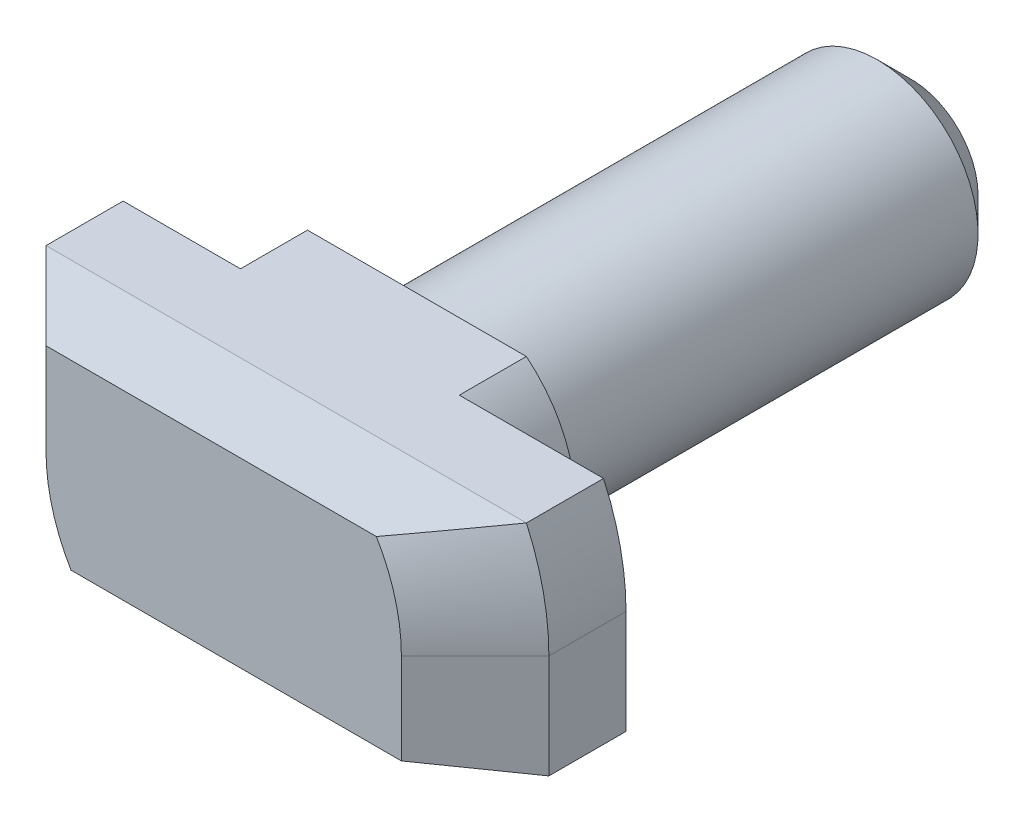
ISO-10303-21;
HEADER;
FILE_DESCRIPTION(('STEP AP214'),'2;1');
FILE_NAME('part.step','',(''),(''),'','','');
FILE_SCHEMA(('AUTOMOTIVE_DESIGN { 1 0 10303 214 1 1 1 1 }'));
ENDSEC;
DATA;
#1=APPLICATION_CONTEXT('core data for automotive mechanical design processes');
#2=APPLICATION_PROTOCOL_DEFINITION('international standard','automotive_design',2000,#1);
#3=PRODUCT_CONTEXT('',#1,'mechanical');
#4=PRODUCT('Part','Part','',(#3));
#5=PRODUCT_RELATED_PRODUCT_CATEGORY('part','',(#4));
#6=PRODUCT_DEFINITION_FORMATION('','',#4);
#7=PRODUCT_DEFINITION_CONTEXT('part definition',#1,'design');
#8=PRODUCT_DEFINITION('design','',#6,#7);
#9=PRODUCT_DEFINITION_SHAPE('','',#8);
#10=(LENGTH_UNIT() NAMED_UNIT(*) SI_UNIT(.MILLI.,.METRE.));
#11=(NAMED_UNIT(*) PLANE_ANGLE_UNIT() SI_UNIT($,.RADIAN.));
#12=(NAMED_UNIT(*) SI_UNIT($,.STERADIAN.) SOLID_ANGLE_UNIT());
#13=UNCERTAINTY_MEASURE_WITH_UNIT(LENGTH_MEASURE(1.E-05),#10,'distance_accuracy_value','');
#14=(GEOMETRIC_REPRESENTATION_CONTEXT(3) GLOBAL_UNCERTAINTY_ASSIGNED_CONTEXT((#13)) GLOBAL_UNIT_ASSIGNED_CONTEXT((#10,
#11,#12)) REPRESENTATION_CONTEXT('',''));
#15=CARTESIAN_POINT('',(0.,0.,0.));
#16=DIRECTION('',(0.,0.,1.));
#17=DIRECTION('',(1.,0.,0.));
#18=AXIS2_PLACEMENT_3D('',#15,#16,#17);
#19=CARTESIAN_POINT('',(5.30000000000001,-3.09999999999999,4.5));
#20=DIRECTION('',(0.707106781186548,0.,0.707106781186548));
#21=DIRECTION('',(0.707106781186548,0.,-0.707106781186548));
#22=AXIS2_PLACEMENT_3D('',#19,#20,#21);
#23=PLANE('',#22);
#24=DIRECTION('',(0.701673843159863,-0.123724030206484,-0.701673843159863));
#25=VECTOR('',#24,1.);
#26=CARTESIAN_POINT('',(5.30000000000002,-2.71208064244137,4.5));
#27=LINE('',#26,#25);
#28=CARTESIAN_POINT('',(5.30000000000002,-2.71208064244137,4.5));
#29=VERTEX_POINT('',#28);
#30=CARTESIAN_POINT('',(7.5,-3.09999999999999,2.3));
#31=VERTEX_POINT('',#30);
#32=EDGE_CURVE('E239',#29,#31,#27,.T.);
#33=ORIENTED_EDGE('',*,*,#32,.T.);
#34=DIRECTION('',(0.,1.,0.));
#35=VECTOR('',#34,1.);
#36=CARTESIAN_POINT('',(7.5,-3.09999999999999,2.30000000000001));
#37=LINE('',#36,#35);
#38=CARTESIAN_POINT('',(7.5,0.,2.30000000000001));
#39=VERTEX_POINT('',#38);
#40=EDGE_CURVE('E241',#39,#31,#37,.F.);
#41=ORIENTED_EDGE('',*,*,#40,.F.);
#42=DIRECTION('',(-0.707106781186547,0.,0.707106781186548));
#43=VECTOR('',#42,1.);
#44=CARTESIAN_POINT('',(7.58485620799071,0.,2.21514379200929));
#45=LINE('',#44,#43);
#46=CARTESIAN_POINT('',(5.30000000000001,0.,4.5));
#47=VERTEX_POINT('',#46);
#48=EDGE_CURVE('E103',#47,#39,#45,.F.);
#49=ORIENTED_EDGE('',*,*,#48,.F.);
#50=DIRECTION('',(0.,-1.,0.));
#51=VECTOR('',#50,1.);
#52=CARTESIAN_POINT('',(5.30000000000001,-3.09999999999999,4.5));
#53=LINE('',#52,#51);
#54=EDGE_CURVE('E271',#29,#47,#53,.F.);
#55=ORIENTED_EDGE('',*,*,#54,.F.);
#56=EDGE_LOOP('',(#33,#41,#49,#55));
#57=FACE_BOUND('',#56,.T.);
#58=ADVANCED_FACE('F16',(#57),#23,.T.);
#59=CARTESIAN_POINT('',(0.,0.,2.30000000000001));
#60=DIRECTION('',(0.,0.,-1.));
#61=DIRECTION('',(0.,1.,0.));
#62=AXIS2_PLACEMENT_3D('',#59,#60,#61);
#63=CONICAL_SURFACE('',#62,7.5,0.785398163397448);
#64=CARTESIAN_POINT('',(-6.82934843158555,-3.09999999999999,2.30000000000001));
#65=CARTESIAN_POINT('',(-6.64116901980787,-3.06741372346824,2.48480595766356));
#66=CARTESIAN_POINT('',(-6.45275253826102,-3.03486855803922,2.66937876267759));
#67=CARTESIAN_POINT('',(-6.07527016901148,-2.96989350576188,3.03787059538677));
#68=CARTESIAN_POINT('',(-5.88620429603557,-2.93746361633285,3.22178963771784));
#69=CARTESIAN_POINT('',(-5.50723735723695,-2.87275034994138,3.58879680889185));
#70=CARTESIAN_POINT('',(-5.31733628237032,-2.84046697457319,3.77188492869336));
#71=CARTESIAN_POINT('',(-4.93637796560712,-2.77610518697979,4.13689876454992));
#72=CARTESIAN_POINT('',(-4.74532069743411,-2.74402677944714,4.31882445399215));
#73=CARTESIAN_POINT('',(-4.55352814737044,-2.71208064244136,4.5));
#74=B_SPLINE_CURVE_WITH_KNOTS('',3,(#64,#65,#66,#67,#68,#69,#70,#71,#72,#73),.UNSPECIFIED.,.F.,
.F.,(4,2,2,2,4),(0.,0.797270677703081,1.59452339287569,2.39178476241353,3.1890643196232),.UNSPECIFIED.);
#75=CARTESIAN_POINT('',(-6.82934843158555,-3.09999999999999,2.30000000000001));
#76=VERTEX_POINT('',#75);
#77=CARTESIAN_POINT('',(-4.55352814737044,-2.71208064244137,4.5));
#78=VERTEX_POINT('',#77);
#79=EDGE_CURVE('E236',#76,#78,#74,.T.);
#80=ORIENTED_EDGE('',*,*,#79,.T.);
#81=CARTESIAN_POINT('',(0.,0.,4.5));
#82=DIRECTION('',(0.,0.,-1.));
#83=DIRECTION('',(0.,1.,0.));
#84=AXIS2_PLACEMENT_3D('',#81,#82,#83);
#85=CIRCLE('',#84,5.30000000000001);
#86=CARTESIAN_POINT('',(-5.3,0.,4.5));
#87=VERTEX_POINT('',#86);
#88=EDGE_CURVE('E19',#87,#78,#85,.F.);
#89=ORIENTED_EDGE('',*,*,#88,.F.);
#90=DIRECTION('',(0.707106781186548,0.,0.707106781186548));
#91=VECTOR('',#90,1.);
#92=CARTESIAN_POINT('',(-7.5,0.,2.3));
#93=LINE('',#92,#91);
#94=CARTESIAN_POINT('',(-7.5,0.,2.30000000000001));
#95=VERTEX_POINT('',#94);
#96=EDGE_CURVE('E268',#95,#87,#93,.T.);
#97=ORIENTED_EDGE('',*,*,#96,.F.);
#98=CARTESIAN_POINT('',(0.,0.,2.30000000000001));
#99=DIRECTION('',(0.,0.,-1.));
#100=DIRECTION('',(0.,1.,0.));
#101=AXIS2_PLACEMENT_3D('',#98,#99,#100);
#102=CIRCLE('',#101,7.5);
#103=EDGE_CURVE('E222',#76,#95,#102,.T.);
#104=ORIENTED_EDGE('',*,*,#103,.F.);
#105=EDGE_LOOP('',(#80,#89,#97,#104));
#106=FACE_BOUND('',#105,.T.);
#107=ADVANCED_FACE('F328',(#106),#63,.T.);
#108=CARTESIAN_POINT('',(-5.30000000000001,-3.09999999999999,4.5));
#109=DIRECTION('',(0.,0.,1.));
#110=DIRECTION('',(0.,-1.,0.));
#111=AXIS2_PLACEMENT_3D('',#108,#109,#110);
#112=PLANE('',#111);
#113=CARTESIAN_POINT('',(0.,0.,4.5));
#114=DIRECTION('',(0.,0.,-1.));
#115=DIRECTION('',(0.,1.,0.));
#116=AXIS2_PLACEMENT_3D('',#113,#114,#115);
#117=CIRCLE('',#116,5.3);
#118=CARTESIAN_POINT('',(4.55352814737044,2.71208064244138,4.5));
#119=VERTEX_POINT('',#118);
#120=EDGE_CURVE('E282',#119,#47,#117,.T.);
#121=ORIENTED_EDGE('',*,*,#120,.F.);
#122=DIRECTION('',(1.,0.,0.));
#123=VECTOR('',#122,1.);
#124=CARTESIAN_POINT('',(-8.7000480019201,2.71208064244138,4.5));
#125=LINE('',#124,#123);
#126=CARTESIAN_POINT('',(-5.3,2.71208064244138,4.5));
#127=VERTEX_POINT('',#126);
#128=EDGE_CURVE('E191',#127,#119,#125,.T.);
#129=ORIENTED_EDGE('',*,*,#128,.F.);
#130=DIRECTION('',(0.,1.,0.));
#131=VECTOR('',#130,1.);
#132=CARTESIAN_POINT('',(-5.3,-3.09999999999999,4.5));
#133=LINE('',#132,#131);
#134=EDGE_CURVE('E263',#87,#127,#133,.T.);
#135=ORIENTED_EDGE('',*,*,#134,.F.);
#136=ORIENTED_EDGE('',*,*,#88,.T.);
#137=DIRECTION('',(1.,0.,0.));
#138=VECTOR('',#137,1.);
#139=CARTESIAN_POINT('',(-8.02939643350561,-2.71208064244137,4.5));
#140=LINE('',#139,#138);
#141=EDGE_CURVE('E226',#78,#29,#140,.T.);
#142=ORIENTED_EDGE('',*,*,#141,.T.);
#143=ORIENTED_EDGE('',*,*,#54,.T.);
#144=EDGE_LOOP('',(#121,#129,#135,#136,#142,#143));
#145=FACE_BOUND('',#144,.T.);
#146=ADVANCED_FACE('F325',(#145),#112,.T.);
#147=CARTESIAN_POINT('',(0.,0.,2.3));
#148=DIRECTION('',(0.,0.,-1.));
#149=DIRECTION('',(0.,1.,0.));
#150=AXIS2_PLACEMENT_3D('',#147,#148,#149);
#151=CONICAL_SURFACE('',#150,7.5,0.785398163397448);
#152=CARTESIAN_POINT('',(4.55352814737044,2.71208064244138,4.5));
#153=CARTESIAN_POINT('',(4.74532069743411,2.74402677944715,4.31882445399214));
#154=CARTESIAN_POINT('',(4.93637796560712,2.77610518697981,4.13689876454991));
#155=CARTESIAN_POINT('',(5.31733628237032,2.84046697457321,3.77188492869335));
#156=CARTESIAN_POINT('',(5.50723735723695,2.8727503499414,3.58879680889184));
#157=CARTESIAN_POINT('',(5.88620429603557,2.93746361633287,3.22178963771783));
#158=CARTESIAN_POINT('',(6.07527016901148,2.9698935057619,3.03787059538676));
#159=CARTESIAN_POINT('',(6.45275253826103,3.03486855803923,2.66937876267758));
#160=CARTESIAN_POINT('',(6.64116901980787,3.06741372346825,2.48480595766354));
#161=CARTESIAN_POINT('',(6.82934843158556,3.1,2.3));
#162=B_SPLINE_CURVE_WITH_KNOTS('',3,(#152,#153,#154,#155,#156,#157,#158,#159,#160,#161),
.UNSPECIFIED.,.F.,.F.,(4,2,2,2,4),(0.,0.797279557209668,1.59454092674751,2.39179364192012,
3.18906431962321),.UNSPECIFIED.);
#163=CARTESIAN_POINT('',(6.82934843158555,3.1,2.29999999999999));
#164=VERTEX_POINT('',#163);
#165=EDGE_CURVE('E194',#119,#164,#162,.T.);
#166=ORIENTED_EDGE('',*,*,#165,.F.);
#167=ORIENTED_EDGE('',*,*,#120,.T.);
#168=ORIENTED_EDGE('',*,*,#48,.T.);
#169=CARTESIAN_POINT('',(0.,0.,2.3));
#170=DIRECTION('',(0.,0.,-1.));
#171=DIRECTION('',(0.,1.,0.));
#172=AXIS2_PLACEMENT_3D('',#169,#170,#171);
#173=CIRCLE('',#172,7.5);
#174=EDGE_CURVE('E259',#164,#39,#173,.T.);
#175=ORIENTED_EDGE('',*,*,#174,.F.);
#176=EDGE_LOOP('',(#166,#167,#168,#175));
#177=FACE_BOUND('',#176,.T.);
#178=ADVANCED_FACE('F319',(#177),#151,.T.);
#179=CARTESIAN_POINT('',(-7.5,-3.09999999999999,2.3));
#180=DIRECTION('',(-0.707106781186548,0.,0.707106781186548));
#181=DIRECTION('',(0.707106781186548,0.,0.707106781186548));
#182=AXIS2_PLACEMENT_3D('',#179,#180,#181);
#183=PLANE('',#182);
#184=DIRECTION('',(0.701673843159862,-0.123724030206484,0.701673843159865));
#185=VECTOR('',#184,1.);
#186=CARTESIAN_POINT('',(-7.50000000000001,3.1,2.29999999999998));
#187=LINE('',#186,#185);
#188=CARTESIAN_POINT('',(-7.5,3.1,2.29999999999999));
#189=VERTEX_POINT('',#188);
#190=EDGE_CURVE('E178',#189,#127,#187,.T.);
#191=ORIENTED_EDGE('',*,*,#190,.F.);
#192=DIRECTION('',(0.,1.,0.));
#193=VECTOR('',#192,1.);
#194=CARTESIAN_POINT('',(-7.5,3.1,2.30000000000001));
#195=LINE('',#194,#193);
#196=EDGE_CURVE('E204',#95,#189,#195,.T.);
#197=ORIENTED_EDGE('',*,*,#196,.F.);
#198=ORIENTED_EDGE('',*,*,#96,.T.);
#199=ORIENTED_EDGE('',*,*,#134,.T.);
#200=EDGE_LOOP('',(#191,#197,#198,#199));
#201=FACE_BOUND('',#200,.T.);
#202=ADVANCED_FACE('F324',(#201),#183,.T.);
#203=CARTESIAN_POINT('',(7.5,-3.09999999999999,0.5));
#204=DIRECTION('',(1.,0.,0.));
#205=DIRECTION('',(0.,0.,-1.));
#206=AXIS2_PLACEMENT_3D('',#203,#204,#205);
#207=PLANE('',#206);
#208=DIRECTION('',(0.,0.,-1.));
#209=VECTOR('',#208,1.);
#210=CARTESIAN_POINT('',(7.5,-3.09999999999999,0.));
#211=LINE('',#210,#209);
#212=CARTESIAN_POINT('',(7.5,-3.09999999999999,0.));
#213=VERTEX_POINT('',#212);
#214=EDGE_CURVE('E231',#213,#31,#211,.F.);
#215=ORIENTED_EDGE('',*,*,#214,.F.);
#216=DIRECTION('',(0.,-1.,0.));
#217=VECTOR('',#216,1.);
#218=CARTESIAN_POINT('',(7.5,3.1,0.));
#219=LINE('',#218,#217);
#220=CARTESIAN_POINT('',(7.5,0.,0.));
#221=VERTEX_POINT('',#220);
#222=EDGE_CURVE('E175',#213,#221,#219,.F.);
#223=ORIENTED_EDGE('',*,*,#222,.T.);
#224=DIRECTION('',(0.,0.,-1.));
#225=VECTOR('',#224,1.);
#226=CARTESIAN_POINT('',(7.5,0.,0.5));
#227=LINE('',#226,#225);
#228=EDGE_CURVE('E250',#221,#39,#227,.F.);
#229=ORIENTED_EDGE('',*,*,#228,.T.);
#230=ORIENTED_EDGE('',*,*,#40,.T.);
#231=EDGE_LOOP('',(#215,#223,#229,#230));
#232=FACE_BOUND('',#231,.T.);
#233=ADVANCED_FACE('F342',(#232),#207,.T.);
#234=CARTESIAN_POINT('',(-8.02939643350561,-3.09999999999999,2.3));
#235=DIRECTION('',(0.,0.984807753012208,-0.173648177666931));
#236=DIRECTION('',(0.,0.173648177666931,0.984807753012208));
#237=AXIS2_PLACEMENT_3D('',#234,#235,#236);
#238=PLANE('',#237);
#239=ORIENTED_EDGE('',*,*,#79,.F.);
#240=DIRECTION('',(1.,0.,0.));
#241=VECTOR('',#240,1.);
#242=CARTESIAN_POINT('',(-2.52784493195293,-3.09999999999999,2.3));
#243=LINE('',#242,#241);
#244=EDGE_CURVE('E221',#31,#76,#243,.F.);
#245=ORIENTED_EDGE('',*,*,#244,.F.);
#246=ORIENTED_EDGE('',*,*,#32,.F.);
#247=ORIENTED_EDGE('',*,*,#141,.F.);
#248=EDGE_LOOP('',(#239,#245,#246,#247));
#249=FACE_BOUND('',#248,.T.);
#250=ADVANCED_FACE('F337',(#249),#238,.F.);
#251=CARTESIAN_POINT('',(0.,0.,0.5));
#252=DIRECTION('',(0.,0.,-1.));
#253=DIRECTION('',(0.,1.,0.));
#254=AXIS2_PLACEMENT_3D('',#251,#252,#253);
#255=CYLINDRICAL_SURFACE('',#254,7.5);
#256=DIRECTION('',(0.,0.,1.));
#257=VECTOR('',#256,1.);
#258=CARTESIAN_POINT('',(-7.5,0.,0.5));
#259=LINE('',#258,#257);
#260=CARTESIAN_POINT('',(-7.5,0.,0.));
#261=VERTEX_POINT('',#260);
#262=EDGE_CURVE('E207',#261,#95,#259,.T.);
#263=ORIENTED_EDGE('',*,*,#262,.F.);
#264=CARTESIAN_POINT('',(0.,0.,0.));
#265=DIRECTION('',(0.,0.,-1.));
#266=DIRECTION('',(0.,1.,0.));
#267=AXIS2_PLACEMENT_3D('',#264,#265,#266);
#268=CIRCLE('',#267,7.5);
#269=CARTESIAN_POINT('',(-6.82934843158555,-3.09999999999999,0.));
#270=VERTEX_POINT('',#269);
#271=EDGE_CURVE('E225',#261,#270,#268,.F.);
#272=ORIENTED_EDGE('',*,*,#271,.T.);
#273=DIRECTION('',(0.,0.,-1.));
#274=VECTOR('',#273,1.);
#275=CARTESIAN_POINT('',(-6.82934843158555,-3.09999999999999,0.));
#276=LINE('',#275,#274);
#277=EDGE_CURVE('E218',#76,#270,#276,.T.);
#278=ORIENTED_EDGE('',*,*,#277,.F.);
#279=ORIENTED_EDGE('',*,*,#103,.T.);
#280=EDGE_LOOP('',(#263,#272,#278,#279));
#281=FACE_BOUND('',#280,.T.);
#282=ADVANCED_FACE('F341',(#281),#255,.T.);
#283=CARTESIAN_POINT('',(7.5,3.1,0.));
#284=DIRECTION('',(0.,0.,1.));
#285=DIRECTION('',(0.,-1.,0.));
#286=AXIS2_PLACEMENT_3D('',#283,#284,#285);
#287=PLANE('',#286);
#288=ORIENTED_EDGE('',*,*,#271,.F.);
#289=DIRECTION('',(0.,1.,0.));
#290=VECTOR('',#289,1.);
#291=CARTESIAN_POINT('',(-7.5,3.1,0.));
#292=LINE('',#291,#290);
#293=CARTESIAN_POINT('',(-7.5,3.1,0.));
#294=VERTEX_POINT('',#293);
#295=EDGE_CURVE('E143',#294,#261,#292,.F.);
#296=ORIENTED_EDGE('',*,*,#295,.F.);
#297=DIRECTION('',(1.,0.,0.));
#298=VECTOR('',#297,1.);
#299=CARTESIAN_POINT('',(2.52784493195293,3.1,0.));
#300=LINE('',#299,#298);
#301=CARTESIAN_POINT('',(-4.,3.1,0.));
#302=VERTEX_POINT('',#301);
#303=EDGE_CURVE('E139',#302,#294,#300,.F.);
#304=ORIENTED_EDGE('',*,*,#303,.F.);
#305=DIRECTION('',(0.,1.,0.));
#306=VECTOR('',#305,1.);
#307=CARTESIAN_POINT('',(-4.,3.1,0.));
#308=LINE('',#307,#306);
#309=CARTESIAN_POINT('',(-4.,0.,0.));
#310=VERTEX_POINT('',#309);
#311=EDGE_CURVE('E128',#310,#302,#308,.T.);
#312=ORIENTED_EDGE('',*,*,#311,.F.);
#313=CARTESIAN_POINT('',(0.,0.,0.));
#314=DIRECTION('',(0.,0.,-1.));
#315=DIRECTION('',(0.,1.,0.));
#316=AXIS2_PLACEMENT_3D('',#313,#314,#315);
#317=CIRCLE('',#316,4.);
#318=CARTESIAN_POINT('',(-2.52784493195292,-3.09999999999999,0.));
#319=VERTEX_POINT('',#318);
#320=EDGE_CURVE('E159',#319,#310,#317,.T.);
#321=ORIENTED_EDGE('',*,*,#320,.F.);
#322=DIRECTION('',(1.,0.,0.));
#323=VECTOR('',#322,1.);
#324=CARTESIAN_POINT('',(-2.52784493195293,-3.09999999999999,0.));
#325=LINE('',#324,#323);
#326=EDGE_CURVE('E163',#270,#319,#325,.T.);
#327=ORIENTED_EDGE('',*,*,#326,.F.);
#328=EDGE_LOOP('',(#288,#296,#304,#312,#321,#327));
#329=FACE_BOUND('',#328,.T.);
#330=ADVANCED_FACE('F141',(#329),#287,.F.);
#331=CARTESIAN_POINT('',(-7.5,3.1,0.5));
#332=DIRECTION('',(-1.,0.,0.));
#333=DIRECTION('',(0.,0.,1.));
#334=AXIS2_PLACEMENT_3D('',#331,#332,#333);
#335=PLANE('',#334);
#336=DIRECTION('',(0.,0.,1.));
#337=VECTOR('',#336,1.);
#338=CARTESIAN_POINT('',(-7.5,3.1,0.));
#339=LINE('',#338,#337);
#340=EDGE_CURVE('E146',#294,#189,#339,.T.);
#341=ORIENTED_EDGE('',*,*,#340,.F.);
#342=ORIENTED_EDGE('',*,*,#295,.T.);
#343=ORIENTED_EDGE('',*,*,#262,.T.);
#344=ORIENTED_EDGE('',*,*,#196,.T.);
#345=EDGE_LOOP('',(#341,#342,#343,#344));
#346=FACE_BOUND('',#345,.T.);
#347=ADVANCED_FACE('F403',(#346),#335,.T.);
#348=CARTESIAN_POINT('',(-8.7000480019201,3.1,2.3));
#349=DIRECTION('',(0.,0.984807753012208,0.17364817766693));
#350=DIRECTION('',(0.,-0.17364817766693,0.984807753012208));
#351=AXIS2_PLACEMENT_3D('',#348,#349,#350);
#352=PLANE('',#351);
#353=DIRECTION('',(1.,0.,0.));
#354=VECTOR('',#353,1.);
#355=CARTESIAN_POINT('',(2.52784493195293,3.1,2.29999999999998));
#356=LINE('',#355,#354);
#357=EDGE_CURVE('E186',#189,#164,#356,.T.);
#358=ORIENTED_EDGE('',*,*,#357,.F.);
#359=ORIENTED_EDGE('',*,*,#190,.T.);
#360=ORIENTED_EDGE('',*,*,#128,.T.);
#361=ORIENTED_EDGE('',*,*,#165,.T.);
#362=EDGE_LOOP('',(#358,#359,#360,#361));
#363=FACE_BOUND('',#362,.T.);
#364=ADVANCED_FACE('F315',(#363),#352,.T.);
#365=CARTESIAN_POINT('',(0.,0.,0.5));
#366=DIRECTION('',(0.,0.,-1.));
#367=DIRECTION('',(0.,1.,0.));
#368=AXIS2_PLACEMENT_3D('',#365,#366,#367);
#369=CYLINDRICAL_SURFACE('',#368,7.5);
#370=DIRECTION('',(0.,0.,1.));
#371=VECTOR('',#370,1.);
#372=CARTESIAN_POINT('',(6.82934843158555,3.1,0.));
#373=LINE('',#372,#371);
#374=CARTESIAN_POINT('',(6.82934843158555,3.1,0.));
#375=VERTEX_POINT('',#374);
#376=EDGE_CURVE('E183',#164,#375,#373,.F.);
#377=ORIENTED_EDGE('',*,*,#376,.F.);
#378=ORIENTED_EDGE('',*,*,#174,.T.);
#379=ORIENTED_EDGE('',*,*,#228,.F.);
#380=CARTESIAN_POINT('',(0.,0.,0.));
#381=DIRECTION('',(0.,0.,-1.));
#382=DIRECTION('',(0.,1.,0.));
#383=AXIS2_PLACEMENT_3D('',#380,#381,#382);
#384=CIRCLE('',#383,7.5);
#385=EDGE_CURVE('E172',#221,#375,#384,.F.);
#386=ORIENTED_EDGE('',*,*,#385,.T.);
#387=EDGE_LOOP('',(#377,#378,#379,#386));
#388=FACE_BOUND('',#387,.T.);
#389=ADVANCED_FACE('F396',(#388),#369,.T.);
#390=CARTESIAN_POINT('',(7.5,3.1,0.));
#391=DIRECTION('',(0.,0.,1.));
#392=DIRECTION('',(0.,-1.,0.));
#393=AXIS2_PLACEMENT_3D('',#390,#391,#392);
#394=PLANE('',#393);
#395=DIRECTION('',(1.,0.,0.));
#396=VECTOR('',#395,1.);
#397=CARTESIAN_POINT('',(2.52784493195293,3.1,0.));
#398=LINE('',#397,#396);
#399=CARTESIAN_POINT('',(2.52784493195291,3.1,0.));
#400=VERTEX_POINT('',#399);
#401=EDGE_CURVE('E181',#375,#400,#398,.F.);
#402=ORIENTED_EDGE('',*,*,#401,.F.);
#403=ORIENTED_EDGE('',*,*,#385,.F.);
#404=ORIENTED_EDGE('',*,*,#222,.F.);
#405=DIRECTION('',(1.,0.,0.));
#406=VECTOR('',#405,1.);
#407=CARTESIAN_POINT('',(-2.52784493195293,-3.09999999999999,0.));
#408=LINE('',#407,#406);
#409=CARTESIAN_POINT('',(4.,-3.09999999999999,0.));
#410=VERTEX_POINT('',#409);
#411=EDGE_CURVE('E167',#410,#213,#408,.T.);
#412=ORIENTED_EDGE('',*,*,#411,.F.);
#413=DIRECTION('',(0.,1.,0.));
#414=VECTOR('',#413,1.);
#415=CARTESIAN_POINT('',(4.,-3.09999999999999,0.));
#416=LINE('',#415,#414);
#417=CARTESIAN_POINT('',(4.,0.,0.));
#418=VERTEX_POINT('',#417);
#419=EDGE_CURVE('E168',#418,#410,#416,.F.);
#420=ORIENTED_EDGE('',*,*,#419,.F.);
#421=CARTESIAN_POINT('',(0.,0.,0.));
#422=DIRECTION('',(0.,0.,-1.));
#423=DIRECTION('',(0.,1.,0.));
#424=AXIS2_PLACEMENT_3D('',#421,#422,#423);
#425=CIRCLE('',#424,4.);
#426=EDGE_CURVE('E301',#400,#418,#425,.T.);
#427=ORIENTED_EDGE('',*,*,#426,.F.);
#428=EDGE_LOOP('',(#402,#403,#404,#412,#420,#427));
#429=FACE_BOUND('',#428,.T.);
#430=ADVANCED_FACE('F393',(#429),#394,.F.);
#431=CARTESIAN_POINT('',(0.,0.,-16.));
#432=DIRECTION('',(0.,0.,1.));
#433=DIRECTION('',(0.,-1.,0.));
#434=AXIS2_PLACEMENT_3D('',#431,#432,#433);
#435=PLANE('',#434);
#436=CARTESIAN_POINT('',(0.,0.,-15.9999999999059));
#437=DIRECTION('',(0.,0.,1.));
#438=DIRECTION('',(0.,-1.,0.));
#439=AXIS2_PLACEMENT_3D('',#436,#437,#438);
#440=CIRCLE('',#439,2.00000000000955);
#441=CARTESIAN_POINT('',(0.,-2.00000000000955,-15.9999999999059));
#442=VERTEX_POINT('',#441);
#443=EDGE_CURVE('E296',#442,#442,#440,.T.);
#444=ORIENTED_EDGE('',*,*,#443,.F.);
#445=EDGE_LOOP('',(#444));
#446=FACE_BOUND('',#445,.T.);
#447=ADVANCED_FACE('F389',(#446),#435,.F.);
#448=CARTESIAN_POINT('',(4.,-3.09999999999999,0.));
#449=DIRECTION('',(1.,0.,0.));
#450=DIRECTION('',(0.,0.,-1.));
#451=AXIS2_PLACEMENT_3D('',#448,#449,#450);
#452=PLANE('',#451);
#453=DIRECTION('',(0.,0.,-1.));
#454=VECTOR('',#453,1.);
#455=CARTESIAN_POINT('',(4.,-3.09999999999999,0.));
#456=LINE('',#455,#454);
#457=CARTESIAN_POINT('',(4.,-3.09999999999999,-2.));
#458=VERTEX_POINT('',#457);
#459=EDGE_CURVE('E164',#458,#410,#456,.F.);
#460=ORIENTED_EDGE('',*,*,#459,.F.);
#461=DIRECTION('',(0.,1.,0.));
#462=VECTOR('',#461,1.);
#463=CARTESIAN_POINT('',(4.,-3.09999999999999,-2.));
#464=LINE('',#463,#462);
#465=CARTESIAN_POINT('',(4.,0.,-2.));
#466=VERTEX_POINT('',#465);
#467=EDGE_CURVE('E299',#466,#458,#464,.F.);
#468=ORIENTED_EDGE('',*,*,#467,.F.);
#469=DIRECTION('',(0.,0.,-1.));
#470=VECTOR('',#469,1.);
#471=CARTESIAN_POINT('',(4.,0.,0.));
#472=LINE('',#471,#470);
#473=EDGE_CURVE('E300',#418,#466,#472,.T.);
#474=ORIENTED_EDGE('',*,*,#473,.F.);
#475=ORIENTED_EDGE('',*,*,#419,.T.);
#476=EDGE_LOOP('',(#460,#468,#474,#475));
#477=FACE_BOUND('',#476,.T.);
#478=ADVANCED_FACE('F385',(#477),#452,.T.);
#479=CARTESIAN_POINT('',(-2.52784493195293,-3.09999999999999,0.));
#480=DIRECTION('',(0.,-1.,0.));
#481=DIRECTION('',(0.,0.,-1.));
#482=AXIS2_PLACEMENT_3D('',#479,#480,#481);
#483=PLANE('',#482);
#484=DIRECTION('',(0.,0.,-1.));
#485=VECTOR('',#484,1.);
#486=CARTESIAN_POINT('',(-2.52784493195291,-3.1,0.));
#487=LINE('',#486,#485);
#488=CARTESIAN_POINT('',(-2.52784493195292,-3.09999999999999,-2.));
#489=VERTEX_POINT('',#488);
#490=EDGE_CURVE('E160',#489,#319,#487,.F.);
#491=ORIENTED_EDGE('',*,*,#490,.F.);
#492=DIRECTION('',(1.,0.,0.));
#493=VECTOR('',#492,1.);
#494=CARTESIAN_POINT('',(-3.10000000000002,-3.09999999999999,-2.));
#495=LINE('',#494,#493);
#496=EDGE_CURVE('E295',#458,#489,#495,.F.);
#497=ORIENTED_EDGE('',*,*,#496,.F.);
#498=ORIENTED_EDGE('',*,*,#459,.T.);
#499=ORIENTED_EDGE('',*,*,#411,.T.);
#500=ORIENTED_EDGE('',*,*,#214,.T.);
#501=ORIENTED_EDGE('',*,*,#244,.T.);
#502=ORIENTED_EDGE('',*,*,#277,.T.);
#503=ORIENTED_EDGE('',*,*,#326,.T.);
#504=EDGE_LOOP('',(#491,#497,#498,#499,#500,#501,#502,#503));
#505=FACE_BOUND('',#504,.T.);
#506=ADVANCED_FACE('F381',(#505),#483,.T.);
#507=CARTESIAN_POINT('',(0.,0.,0.));
#508=DIRECTION('',(0.,0.,-1.));
#509=DIRECTION('',(0.,1.,0.));
#510=AXIS2_PLACEMENT_3D('',#507,#508,#509);
#511=CYLINDRICAL_SURFACE('',#510,4.);
#512=DIRECTION('',(0.,0.,1.));
#513=VECTOR('',#512,1.);
#514=CARTESIAN_POINT('',(-4.,0.,0.));
#515=LINE('',#514,#513);
#516=CARTESIAN_POINT('',(-4.,0.,-2.));
#517=VERTEX_POINT('',#516);
#518=EDGE_CURVE('E134',#517,#310,#515,.T.);
#519=ORIENTED_EDGE('',*,*,#518,.F.);
#520=CARTESIAN_POINT('',(0.,0.,-2.));
#521=DIRECTION('',(0.,0.,-1.));
#522=DIRECTION('',(0.,1.,0.));
#523=AXIS2_PLACEMENT_3D('',#520,#521,#522);
#524=CIRCLE('',#523,4.);
#525=EDGE_CURVE('E291',#489,#517,#524,.T.);
#526=ORIENTED_EDGE('',*,*,#525,.F.);
#527=ORIENTED_EDGE('',*,*,#490,.T.);
#528=ORIENTED_EDGE('',*,*,#320,.T.);
#529=EDGE_LOOP('',(#519,#526,#527,#528));
#530=FACE_BOUND('',#529,.T.);
#531=ADVANCED_FACE('F378',(#530),#511,.T.);
#532=CARTESIAN_POINT('',(-4.,3.1,0.));
#533=DIRECTION('',(-1.,0.,0.));
#534=DIRECTION('',(0.,0.,1.));
#535=AXIS2_PLACEMENT_3D('',#532,#533,#534);
#536=PLANE('',#535);
#537=DIRECTION('',(0.,0.,1.));
#538=VECTOR('',#537,1.);
#539=CARTESIAN_POINT('',(-4.,3.1,0.));
#540=LINE('',#539,#538);
#541=CARTESIAN_POINT('',(-4.,3.1,-2.));
#542=VERTEX_POINT('',#541);
#543=EDGE_CURVE('E133',#542,#302,#540,.T.);
#544=ORIENTED_EDGE('',*,*,#543,.F.);
#545=DIRECTION('',(0.,1.,0.));
#546=VECTOR('',#545,1.);
#547=CARTESIAN_POINT('',(-4.,-3.09999999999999,-2.));
#548=LINE('',#547,#546);
#549=EDGE_CURVE('E294',#517,#542,#548,.T.);
#550=ORIENTED_EDGE('',*,*,#549,.F.);
#551=ORIENTED_EDGE('',*,*,#518,.T.);
#552=ORIENTED_EDGE('',*,*,#311,.T.);
#553=EDGE_LOOP('',(#544,#550,#551,#552));
#554=FACE_BOUND('',#553,.T.);
#555=ADVANCED_FACE('F130',(#554),#536,.T.);
#556=CARTESIAN_POINT('',(2.52784493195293,3.1,0.));
#557=DIRECTION('',(0.,1.,0.));
#558=DIRECTION('',(0.,0.,1.));
#559=AXIS2_PLACEMENT_3D('',#556,#557,#558);
#560=PLANE('',#559);
#561=DIRECTION('',(0.,0.,-1.));
#562=VECTOR('',#561,1.);
#563=CARTESIAN_POINT('',(2.52784493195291,3.1,0.));
#564=LINE('',#563,#562);
#565=CARTESIAN_POINT('',(2.52784493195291,3.1,-2.));
#566=VERTEX_POINT('',#565);
#567=EDGE_CURVE('E34',#566,#400,#564,.F.);
#568=ORIENTED_EDGE('',*,*,#567,.F.);
#569=DIRECTION('',(1.,0.,0.));
#570=VECTOR('',#569,1.);
#571=CARTESIAN_POINT('',(-3.10000000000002,3.1,-2.));
#572=LINE('',#571,#570);
#573=EDGE_CURVE('E150',#542,#566,#572,.T.);
#574=ORIENTED_EDGE('',*,*,#573,.F.);
#575=ORIENTED_EDGE('',*,*,#543,.T.);
#576=ORIENTED_EDGE('',*,*,#303,.T.);
#577=ORIENTED_EDGE('',*,*,#340,.T.);
#578=ORIENTED_EDGE('',*,*,#357,.T.);
#579=ORIENTED_EDGE('',*,*,#376,.T.);
#580=ORIENTED_EDGE('',*,*,#401,.T.);
#581=EDGE_LOOP('',(#568,#574,#575,#576,#577,#578,#579,#580));
#582=FACE_BOUND('',#581,.T.);
#583=ADVANCED_FACE('F148',(#582),#560,.T.);
#584=CARTESIAN_POINT('',(0.,0.,0.));
#585=DIRECTION('',(0.,0.,-1.));
#586=DIRECTION('',(0.,1.,0.));
#587=AXIS2_PLACEMENT_3D('',#584,#585,#586);
#588=CYLINDRICAL_SURFACE('',#587,4.);
#589=ORIENTED_EDGE('',*,*,#473,.T.);
#590=CARTESIAN_POINT('',(0.,0.,-2.));
#591=DIRECTION('',(0.,0.,-1.));
#592=DIRECTION('',(0.,1.,0.));
#593=AXIS2_PLACEMENT_3D('',#590,#591,#592);
#594=CIRCLE('',#593,4.);
#595=EDGE_CURVE('E288',#566,#466,#594,.T.);
#596=ORIENTED_EDGE('',*,*,#595,.F.);
#597=ORIENTED_EDGE('',*,*,#567,.T.);
#598=ORIENTED_EDGE('',*,*,#426,.T.);
#599=EDGE_LOOP('',(#589,#596,#597,#598));
#600=FACE_BOUND('',#599,.T.);
#601=ADVANCED_FACE('F369',(#600),#588,.T.);
#602=CARTESIAN_POINT('',(0.,0.,-14.9999999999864));
#603=DIRECTION('',(0.,0.,1.));
#604=DIRECTION('',(0.,-1.,0.));
#605=AXIS2_PLACEMENT_3D('',#602,#603,#604);
#606=CONICAL_SURFACE('',#605,2.99999999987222,0.785398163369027);
#607=CARTESIAN_POINT('',(0.,0.,-15.));
#608=DIRECTION('',(0.,0.,-1.));
#609=DIRECTION('',(0.,1.,0.));
#610=AXIS2_PLACEMENT_3D('',#607,#608,#609);
#611=CIRCLE('',#610,3.);
#612=CARTESIAN_POINT('',(0.,3.,-15.));
#613=VERTEX_POINT('',#612);
#614=EDGE_CURVE('E25',#613,#613,#611,.F.);
#615=ORIENTED_EDGE('',*,*,#614,.F.);
#616=EDGE_LOOP('',(#615));
#617=FACE_BOUND('',#616,.T.);
#618=ORIENTED_EDGE('',*,*,#443,.T.);
#619=EDGE_LOOP('',(#618));
#620=FACE_BOUND('',#619,.T.);
#621=ADVANCED_FACE('F361',(#617,#620),#606,.T.);
#622=CARTESIAN_POINT('',(-3.10000000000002,-3.09999999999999,-2.));
#623=DIRECTION('',(0.,0.,-1.));
#624=DIRECTION('',(0.,1.,0.));
#625=AXIS2_PLACEMENT_3D('',#622,#623,#624);
#626=PLANE('',#625);
#627=CARTESIAN_POINT('',(0.,0.,-2.));
#628=DIRECTION('',(0.,0.,-1.));
#629=DIRECTION('',(0.,1.,0.));
#630=AXIS2_PLACEMENT_3D('',#627,#628,#629);
#631=CIRCLE('',#630,3.);
#632=CARTESIAN_POINT('',(0.,3.,-2.));
#633=VERTEX_POINT('',#632);
#634=EDGE_CURVE('E10',#633,#633,#631,.T.);
#635=ORIENTED_EDGE('',*,*,#634,.F.);
#636=EDGE_LOOP('',(#635));
#637=FACE_BOUND('',#636,.T.);
#638=ORIENTED_EDGE('',*,*,#573,.T.);
#639=ORIENTED_EDGE('',*,*,#595,.T.);
#640=ORIENTED_EDGE('',*,*,#467,.T.);
#641=ORIENTED_EDGE('',*,*,#496,.T.);
#642=ORIENTED_EDGE('',*,*,#525,.T.);
#643=ORIENTED_EDGE('',*,*,#549,.T.);
#644=EDGE_LOOP('',(#638,#639,#640,#641,#642,#643));
#645=FACE_BOUND('',#644,.T.);
#646=ADVANCED_FACE('F355',(#637,#645),#626,.T.);
#647=CARTESIAN_POINT('',(0.,0.,-2.));
#648=DIRECTION('',(0.,0.,-1.));
#649=DIRECTION('',(0.,1.,0.));
#650=AXIS2_PLACEMENT_3D('',#647,#648,#649);
#651=CYLINDRICAL_SURFACE('',#650,3.);
#652=ORIENTED_EDGE('',*,*,#614,.T.);
#653=EDGE_LOOP('',(#652));
#654=FACE_BOUND('',#653,.T.);
#655=ORIENTED_EDGE('',*,*,#634,.T.);
#656=EDGE_LOOP('',(#655));
#657=FACE_BOUND('',#656,.T.);
#658=ADVANCED_FACE('F353',(#654,#657),#651,.T.);
#659=CLOSED_SHELL('',(#58,#107,#146,#178,#202,#233,#250,#282,#330,#347,#364,#389,#430,#447,#478,
#506,#531,#555,#583,#601,#621,#646,#658));
#660=MANIFOLD_SOLID_BREP('B1',#659);
#661=ADVANCED_BREP_SHAPE_REPRESENTATION('',(#18,#660),#14);
#662=SHAPE_DEFINITION_REPRESENTATION(#9,#661);
ENDSEC;
END-ISO-10303-21;
